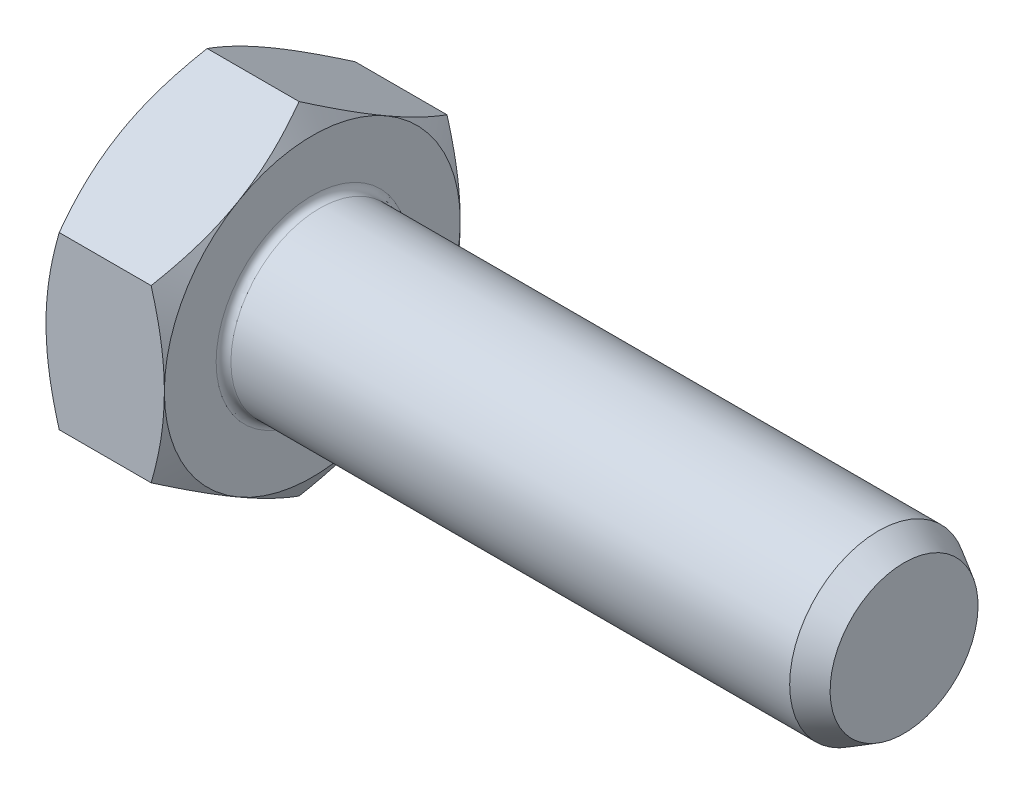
ISO-10303-21;
HEADER;
FILE_DESCRIPTION(('STEP AP214'),'2;1');
FILE_NAME('part.step','',(''),(''),'','','');
FILE_SCHEMA(('AUTOMOTIVE_DESIGN { 1 0 10303 214 1 1 1 1 }'));
ENDSEC;
DATA;
#1=APPLICATION_CONTEXT('core data for automotive mechanical design processes');
#2=APPLICATION_PROTOCOL_DEFINITION('international standard','automotive_design',2000,#1);
#3=PRODUCT_CONTEXT('',#1,'mechanical');
#4=PRODUCT('Part','Part','',(#3));
#5=PRODUCT_RELATED_PRODUCT_CATEGORY('part','',(#4));
#6=PRODUCT_DEFINITION_FORMATION('','',#4);
#7=PRODUCT_DEFINITION_CONTEXT('part definition',#1,'design');
#8=PRODUCT_DEFINITION('design','',#6,#7);
#9=PRODUCT_DEFINITION_SHAPE('','',#8);
#10=(LENGTH_UNIT() NAMED_UNIT(*) SI_UNIT(.MILLI.,.METRE.));
#11=(NAMED_UNIT(*) PLANE_ANGLE_UNIT() SI_UNIT($,.RADIAN.));
#12=(NAMED_UNIT(*) SI_UNIT($,.STERADIAN.) SOLID_ANGLE_UNIT());
#13=UNCERTAINTY_MEASURE_WITH_UNIT(LENGTH_MEASURE(1.E-05),#10,'distance_accuracy_value','');
#14=(GEOMETRIC_REPRESENTATION_CONTEXT(3) GLOBAL_UNCERTAINTY_ASSIGNED_CONTEXT((#13)) GLOBAL_UNIT_ASSIGNED_CONTEXT((#10,
#11,#12)) REPRESENTATION_CONTEXT('',''));
#15=CARTESIAN_POINT('',(0.,0.,0.));
#16=DIRECTION('',(0.,0.,1.));
#17=DIRECTION('',(1.,0.,0.));
#18=AXIS2_PLACEMENT_3D('',#15,#16,#17);
#19=CARTESIAN_POINT('',(0.,0.,-10.));
#20=DIRECTION('',(-1.,0.,0.));
#21=DIRECTION('',(0.,0.,1.));
#22=AXIS2_PLACEMENT_3D('',#19,#20,#21);
#23=PLANE('',#22);
#24=CARTESIAN_POINT('',(0.,0.,0.));
#25=DIRECTION('',(-1.,0.,0.));
#26=DIRECTION('',(0.,0.,1.));
#27=AXIS2_PLACEMENT_3D('',#24,#25,#26);
#28=CIRCLE('',#27,5.);
#29=CARTESIAN_POINT('',(0.,-4.3301270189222,2.5));
#30=VERTEX_POINT('',#29);
#31=CARTESIAN_POINT('',(0.,0.,5.));
#32=VERTEX_POINT('',#31);
#33=EDGE_CURVE('E170',#30,#32,#28,.T.);
#34=ORIENTED_EDGE('',*,*,#33,.T.);
#35=CARTESIAN_POINT('',(0.,0.,0.));
#36=DIRECTION('',(-1.,0.,0.));
#37=DIRECTION('',(0.,0.,1.));
#38=AXIS2_PLACEMENT_3D('',#35,#36,#37);
#39=CIRCLE('',#38,5.);
#40=CARTESIAN_POINT('',(0.,4.33012701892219,2.5));
#41=VERTEX_POINT('',#40);
#42=EDGE_CURVE('E226',#32,#41,#39,.T.);
#43=ORIENTED_EDGE('',*,*,#42,.T.);
#44=CARTESIAN_POINT('',(0.,4.33012701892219,-2.5));
#45=VERTEX_POINT('',#44);
#46=EDGE_CURVE('E173',#41,#45,#28,.T.);
#47=ORIENTED_EDGE('',*,*,#46,.T.);
#48=CARTESIAN_POINT('',(0.,0.,-5.));
#49=VERTEX_POINT('',#48);
#50=EDGE_CURVE('E180',#45,#49,#28,.T.);
#51=ORIENTED_EDGE('',*,*,#50,.T.);
#52=CARTESIAN_POINT('',(0.,-4.33012701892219,-2.5));
#53=VERTEX_POINT('',#52);
#54=EDGE_CURVE('E178',#49,#53,#28,.T.);
#55=ORIENTED_EDGE('',*,*,#54,.T.);
#56=EDGE_CURVE('E172',#53,#30,#28,.T.);
#57=ORIENTED_EDGE('',*,*,#56,.T.);
#58=EDGE_LOOP('',(#34,#43,#47,#51,#55,#57));
#59=FACE_BOUND('',#58,.T.);
#60=CARTESIAN_POINT('',(0.,0.,0.));
#61=DIRECTION('',(-1.,0.,0.));
#62=DIRECTION('',(0.,0.,1.));
#63=AXIS2_PLACEMENT_3D('',#60,#61,#62);
#64=CIRCLE('',#63,4.16666666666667);
#65=CARTESIAN_POINT('',(0.,0.,4.16666666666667));
#66=VERTEX_POINT('',#65);
#67=EDGE_CURVE('E367',#66,#66,#64,.T.);
#68=ORIENTED_EDGE('',*,*,#67,.F.);
#69=EDGE_LOOP('',(#68));
#70=FACE_BOUND('',#69,.T.);
#71=ADVANCED_FACE('F43',(#59,#70),#23,.T.);
#72=CARTESIAN_POINT('',(-14.1054061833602,0.,0.));
#73=DIRECTION('',(-1.,0.,0.));
#74=DIRECTION('',(0.,0.,1.));
#75=AXIS2_PLACEMENT_3D('',#72,#73,#74);
#76=CYLINDRICAL_SURFACE('',#75,3.);
#77=CARTESIAN_POINT('',(4.25,0.,0.));
#78=DIRECTION('',(-1.,0.,0.));
#79=DIRECTION('',(0.,0.,1.));
#80=AXIS2_PLACEMENT_3D('',#77,#78,#79);
#81=CIRCLE('',#80,3.);
#82=CARTESIAN_POINT('',(4.25,0.,3.));
#83=VERTEX_POINT('',#82);
#84=EDGE_CURVE('E159',#83,#83,#81,.F.);
#85=ORIENTED_EDGE('',*,*,#84,.T.);
#86=EDGE_LOOP('',(#85));
#87=FACE_BOUND('',#86,.T.);
#88=CARTESIAN_POINT('',(23.1339745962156,0.,0.));
#89=DIRECTION('',(1.,0.,0.));
#90=DIRECTION('',(0.,1.,0.));
#91=AXIS2_PLACEMENT_3D('',#88,#89,#90);
#92=CIRCLE('',#91,3.);
#93=CARTESIAN_POINT('',(23.1339745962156,3.,0.));
#94=VERTEX_POINT('',#93);
#95=EDGE_CURVE('E365',#94,#94,#92,.T.);
#96=ORIENTED_EDGE('',*,*,#95,.F.);
#97=EDGE_LOOP('',(#96));
#98=FACE_BOUND('',#97,.T.);
#99=ADVANCED_FACE('F338',(#87,#98),#76,.T.);
#100=CARTESIAN_POINT('',(4.,0.,-10.));
#101=DIRECTION('',(-1.,0.,0.));
#102=DIRECTION('',(0.,0.,1.));
#103=AXIS2_PLACEMENT_3D('',#100,#101,#102);
#104=PLANE('',#103);
#105=CARTESIAN_POINT('',(4.,0.,0.));
#106=DIRECTION('',(-1.,0.,0.));
#107=DIRECTION('',(0.,0.,1.));
#108=AXIS2_PLACEMENT_3D('',#105,#106,#107);
#109=CIRCLE('',#108,3.25);
#110=CARTESIAN_POINT('',(4.,0.,3.25));
#111=VERTEX_POINT('',#110);
#112=EDGE_CURVE('E167',#111,#111,#109,.T.);
#113=ORIENTED_EDGE('',*,*,#112,.T.);
#114=EDGE_LOOP('',(#113));
#115=FACE_BOUND('',#114,.T.);
#116=CARTESIAN_POINT('',(4.,0.,0.));
#117=DIRECTION('',(-1.,0.,0.));
#118=DIRECTION('',(0.,0.,1.));
#119=AXIS2_PLACEMENT_3D('',#116,#117,#118);
#120=CIRCLE('',#119,5.);
#121=CARTESIAN_POINT('',(4.,0.,5.));
#122=VERTEX_POINT('',#121);
#123=CARTESIAN_POINT('',(4.,4.33012701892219,2.5));
#124=VERTEX_POINT('',#123);
#125=EDGE_CURVE('E138',#122,#124,#120,.T.);
#126=ORIENTED_EDGE('',*,*,#125,.F.);
#127=CARTESIAN_POINT('',(4.,0.,0.));
#128=DIRECTION('',(-1.,0.,0.));
#129=DIRECTION('',(0.,0.,1.));
#130=AXIS2_PLACEMENT_3D('',#127,#128,#129);
#131=CIRCLE('',#130,5.);
#132=CARTESIAN_POINT('',(4.,-4.3301270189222,2.5));
#133=VERTEX_POINT('',#132);
#134=EDGE_CURVE('E47',#133,#122,#131,.T.);
#135=ORIENTED_EDGE('',*,*,#134,.F.);
#136=CARTESIAN_POINT('',(4.,-4.33012701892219,-2.5));
#137=VERTEX_POINT('',#136);
#138=EDGE_CURVE('E183',#137,#133,#131,.T.);
#139=ORIENTED_EDGE('',*,*,#138,.F.);
#140=CARTESIAN_POINT('',(4.,0.,-5.));
#141=VERTEX_POINT('',#140);
#142=EDGE_CURVE('E575',#141,#137,#131,.T.);
#143=ORIENTED_EDGE('',*,*,#142,.F.);
#144=CARTESIAN_POINT('',(4.,4.33012701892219,-2.5));
#145=VERTEX_POINT('',#144);
#146=EDGE_CURVE('E52',#145,#141,#131,.T.);
#147=ORIENTED_EDGE('',*,*,#146,.F.);
#148=EDGE_CURVE('E11',#124,#145,#131,.T.);
#149=ORIENTED_EDGE('',*,*,#148,.F.);
#150=EDGE_LOOP('',(#126,#135,#139,#143,#147,#149));
#151=FACE_BOUND('',#150,.T.);
#152=ADVANCED_FACE('F344',(#115,#151),#104,.F.);
#153=CARTESIAN_POINT('',(4.25,0.,0.));
#154=DIRECTION('',(-1.,0.,0.));
#155=DIRECTION('',(0.,0.,1.));
#156=AXIS2_PLACEMENT_3D('',#153,#154,#155);
#157=TOROIDAL_SURFACE('',#156,3.25,0.25);
#158=ORIENTED_EDGE('',*,*,#112,.F.);
#159=EDGE_LOOP('',(#158));
#160=FACE_BOUND('',#159,.T.);
#161=ORIENTED_EDGE('',*,*,#84,.F.);
#162=EDGE_LOOP('',(#161));
#163=FACE_BOUND('',#162,.T.);
#164=ADVANCED_FACE('F45',(#160,#163),#157,.F.);
#165=CARTESIAN_POINT('',(3.5534180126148,0.,0.));
#166=DIRECTION('',(-1.,0.,0.));
#167=DIRECTION('',(0.,0.,1.));
#168=AXIS2_PLACEMENT_3D('',#165,#166,#167);
#169=CONICAL_SURFACE('',#168,5.77350269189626,1.04719755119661);
#170=CARTESIAN_POINT('',(1.60736647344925,-7.65608998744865,5.));
#171=CARTESIAN_POINT('',(1.71345466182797,-7.43656171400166,5.));
#172=CARTESIAN_POINT('',(1.81848824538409,-7.21651440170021,5.));
#173=CARTESIAN_POINT('',(2.02584356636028,-6.77510105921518,5.));
#174=CARTESIAN_POINT('',(2.12816483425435,-6.55373480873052,5.));
#175=CARTESIAN_POINT('',(2.33003192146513,-6.10820714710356,5.));
#176=CARTESIAN_POINT('',(2.42955850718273,-5.88403698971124,5.));
#177=CARTESIAN_POINT('',(2.62433676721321,-5.43385418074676,5.));
#178=CARTESIAN_POINT('',(2.7195886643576,-5.20784162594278,5.));
#179=CARTESIAN_POINT('',(2.90581169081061,-4.75080884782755,5.));
#180=CARTESIAN_POINT('',(2.99671590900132,-4.51976121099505,5.));
#181=CARTESIAN_POINT('',(3.17140469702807,-4.05494053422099,5.));
#182=CARTESIAN_POINT('',(3.25518847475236,-3.82116719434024,5.));
#183=CARTESIAN_POINT('',(3.41338536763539,-3.35100416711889,5.));
#184=CARTESIAN_POINT('',(3.48781840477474,-3.11462125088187,5.));
#185=CARTESIAN_POINT('',(3.62489560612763,-2.63849247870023,5.));
#186=CARTESIAN_POINT('',(3.68754349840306,-2.3987477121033,5.));
#187=CARTESIAN_POINT('',(3.79801224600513,-1.91574303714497,5.));
#188=CARTESIAN_POINT('',(3.84582915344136,-1.672482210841,5.));
#189=CARTESIAN_POINT('',(3.9234044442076,-1.18299359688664,5.));
#190=CARTESIAN_POINT('',(3.95316281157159,-0.936765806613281,5.));
#191=CARTESIAN_POINT('',(3.9823487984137,-0.567032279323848,5.));
#192=CARTESIAN_POINT('',(3.98950368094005,-0.444105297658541,5.));
#193=CARTESIAN_POINT('',(3.99860454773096,-0.198053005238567,5.));
#194=CARTESIAN_POINT('',(4.00055059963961,-0.0749276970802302,5.));
#195=CARTESIAN_POINT('',(3.99918152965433,0.171257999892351,5.));
#196=CARTESIAN_POINT('',(3.99586788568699,0.294318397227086,5.));
#197=CARTESIAN_POINT('',(3.98406340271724,0.540192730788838,5.));
#198=CARTESIAN_POINT('',(3.97557230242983,0.66300665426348,5.));
#199=CARTESIAN_POINT('',(3.9488936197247,0.960681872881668,5.));
#200=CARTESIAN_POINT('',(3.92811103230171,1.1353143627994,5.));
#201=CARTESIAN_POINT('',(3.8772343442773,1.4832167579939,5.));
#202=CARTESIAN_POINT('',(3.84713900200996,1.65648647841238,5.));
#203=CARTESIAN_POINT('',(3.77870120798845,2.00155426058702,5.));
#204=CARTESIAN_POINT('',(3.74035052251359,2.17335067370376,5.));
#205=CARTESIAN_POINT('',(3.65657169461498,2.51518168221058,5.));
#206=CARTESIAN_POINT('',(3.61114398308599,2.68521638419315,5.));
#207=CARTESIAN_POINT('',(3.5131122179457,3.02770318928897,5.));
#208=CARTESIAN_POINT('',(3.46035963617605,3.20011248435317,5.));
#209=CARTESIAN_POINT('',(3.34964221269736,3.54310870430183,5.));
#210=CARTESIAN_POINT('',(3.29168096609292,3.71369679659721,5.));
#211=CARTESIAN_POINT('',(3.17174345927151,4.05236610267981,5.));
#212=CARTESIAN_POINT('',(3.10979163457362,4.22045602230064,5.));
#213=CARTESIAN_POINT('',(2.98225176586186,4.55533171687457,5.));
#214=CARTESIAN_POINT('',(2.91666225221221,4.72211693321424,5.));
#215=CARTESIAN_POINT('',(2.84961374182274,4.88829623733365,5.));
#216=B_SPLINE_CURVE_WITH_KNOTS('',3,(#170,#171,#172,#173,#174,#175,#176,#177,#178,#179,#180,
#181,#182,#183,#184,#185,#186,#187,#188,#189,#190,#191,#192,#193,#194,#195,#196,#197,#198,#199,
#200,#201,#202,#203,#204,#205,#206,#207,#208,#209,#210,#211,#212,#213,#214,#215),.UNSPECIFIED.,
.F.,.F.,(4,2,2,2,2,2,2,2,2,2,2,2,2,2,2,2,2,2,2,2,2,2,4),(0.,0.731464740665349,1.46305528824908,
2.19883243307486,2.93457117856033,3.67934251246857,4.4241965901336,5.16743580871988,
5.91043951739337,6.65364083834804,7.39684281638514,7.76615414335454,8.13546067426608,
8.50466345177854,8.8738848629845,9.40118542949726,9.92855633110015,10.4564556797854,
10.9843228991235,11.5251202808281,12.0655472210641,12.6029322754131,13.1405360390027),.UNSPECIFIED.);
#217=CARTESIAN_POINT('',(3.5534180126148,-2.88675134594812,5.00000000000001));
#218=VERTEX_POINT('',#217);
#219=EDGE_CURVE('E150',#122,#218,#216,.F.);
#220=ORIENTED_EDGE('',*,*,#219,.T.);
#221=CARTESIAN_POINT('',(3.55335134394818,-2.88663587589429,5.0002));
#222=CARTESIAN_POINT('',(3.62661343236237,-3.01349970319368,4.78046540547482));
#223=CARTESIAN_POINT('',(3.69324867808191,-3.14144859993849,4.55885141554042));
#224=CARTESIAN_POINT('',(3.80956100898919,-3.39956193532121,4.11178600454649));
#225=CARTESIAN_POINT('',(3.85919695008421,-3.52973095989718,3.88632664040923));
#226=CARTESIAN_POINT('',(3.9364489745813,-3.78847564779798,3.43816769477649));
#227=CARTESIAN_POINT('',(3.96457962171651,-3.91701101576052,3.21553790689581));
#228=CARTESIAN_POINT('',(3.98980507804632,-4.11026620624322,2.88081009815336));
#229=CARTESIAN_POINT('',(3.99538654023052,-4.17472868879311,2.76915780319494));
#230=CARTESIAN_POINT('',(4.00079778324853,-4.30371322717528,2.54575002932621));
#231=CARTESIAN_POINT('',(4.0006277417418,-4.36823528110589,2.43399455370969));
#232=CARTESIAN_POINT('',(3.99224636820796,-4.54500768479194,2.12781576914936));
#233=CARTESIAN_POINT('',(3.97817022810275,-4.65719946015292,1.93349391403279));
#234=CARTESIAN_POINT('',(3.93353474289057,-4.88083840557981,1.5461398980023));
#235=CARTESIAN_POINT('',(3.90296013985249,-4.9922847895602,1.35310909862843));
#236=CARTESIAN_POINT('',(3.82653150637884,-5.21637431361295,0.964974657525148));
#237=CARTESIAN_POINT('',(3.78035362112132,-5.32898917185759,0.769920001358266));
#238=CARTESIAN_POINT('',(3.67554820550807,-5.55253939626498,0.382719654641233));
#239=CARTESIAN_POINT('',(3.61694529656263,-5.66347762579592,0.190569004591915));
#240=CARTESIAN_POINT('',(3.55335134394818,-5.7736181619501,-0.00019999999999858));
#241=B_SPLINE_CURVE_WITH_KNOTS('',3,(#221,#222,#223,#224,#225,#226,#227,#228,#229,#230,#231,
#232,#233,#234,#235,#236,#237,#238,#239,#240),.UNSPECIFIED.,.F.,.F.,(4,2,2,2,2,2,2,2,2,4),(0.,
0.792555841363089,1.58701660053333,2.3618153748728,2.74884076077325,3.13585419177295,
3.80962362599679,4.48401723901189,5.17336882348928,5.86136694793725),.UNSPECIFIED.);
#242=EDGE_CURVE('E572',#218,#133,#241,.T.);
#243=ORIENTED_EDGE('',*,*,#242,.T.);
#244=ORIENTED_EDGE('',*,*,#134,.T.);
#245=EDGE_LOOP('',(#220,#243,#244));
#246=FACE_BOUND('',#245,.T.);
#247=ADVANCED_FACE('F455',(#246),#169,.T.);
#248=CARTESIAN_POINT('',(3.5534180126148,-5.77350269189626,0.));
#249=VERTEX_POINT('',#248);
#250=EDGE_CURVE('E277',#133,#249,#241,.T.);
#251=ORIENTED_EDGE('',*,*,#250,.T.);
#252=CARTESIAN_POINT('',(3.55335134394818,-5.7736181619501,0.000200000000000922));
#253=CARTESIAN_POINT('',(3.62661343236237,-5.64675433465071,-0.219534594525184));
#254=CARTESIAN_POINT('',(3.69324867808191,-5.5188054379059,-0.441148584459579));
#255=CARTESIAN_POINT('',(3.80956100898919,-5.26069210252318,-0.888213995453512));
#256=CARTESIAN_POINT('',(3.85919695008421,-5.13052307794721,-1.11367335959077));
#257=CARTESIAN_POINT('',(3.9364489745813,-4.87177839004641,-1.56183230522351));
#258=CARTESIAN_POINT('',(3.96457962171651,-4.74324302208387,-1.78446209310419));
#259=CARTESIAN_POINT('',(3.98980507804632,-4.54998783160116,-2.11918990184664));
#260=CARTESIAN_POINT('',(3.99538654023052,-4.48552534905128,-2.23084219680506));
#261=CARTESIAN_POINT('',(4.00079778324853,-4.35654081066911,-2.45424997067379));
#262=CARTESIAN_POINT('',(4.0006277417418,-4.2920187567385,-2.56600544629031));
#263=CARTESIAN_POINT('',(3.99224636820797,-4.11524635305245,-2.87218423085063));
#264=CARTESIAN_POINT('',(3.97817022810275,-4.00305457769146,-3.06650608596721));
#265=CARTESIAN_POINT('',(3.93353474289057,-3.77941563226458,-3.4538601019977));
#266=CARTESIAN_POINT('',(3.90296013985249,-3.66796924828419,-3.64689090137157));
#267=CARTESIAN_POINT('',(3.82653150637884,-3.44387972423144,-4.03502534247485));
#268=CARTESIAN_POINT('',(3.78035362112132,-3.3312648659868,-4.23007999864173));
#269=CARTESIAN_POINT('',(3.67554820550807,-3.1077146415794,-4.61728034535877));
#270=CARTESIAN_POINT('',(3.61694529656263,-2.99677641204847,-4.80943099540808));
#271=CARTESIAN_POINT('',(3.55335134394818,-2.88663587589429,-5.0002));
#272=B_SPLINE_CURVE_WITH_KNOTS('',3,(#252,#253,#254,#255,#256,#257,#258,#259,#260,#261,#262,
#263,#264,#265,#266,#267,#268,#269,#270,#271),.UNSPECIFIED.,.F.,.F.,(4,2,2,2,2,2,2,2,2,4),(0.,
0.79255584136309,1.58701660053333,2.3618153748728,2.74884076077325,3.13585419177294,
3.80962362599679,4.48401723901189,5.17336882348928,5.86136694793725),.UNSPECIFIED.);
#273=EDGE_CURVE('E573',#249,#137,#272,.T.);
#274=ORIENTED_EDGE('',*,*,#273,.T.);
#275=ORIENTED_EDGE('',*,*,#138,.T.);
#276=EDGE_LOOP('',(#251,#274,#275));
#277=FACE_BOUND('',#276,.T.);
#278=ADVANCED_FACE('F476',(#277),#169,.T.);
#279=CARTESIAN_POINT('',(3.5534180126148,-2.88675134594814,-5.));
#280=VERTEX_POINT('',#279);
#281=EDGE_CURVE('E258',#137,#280,#272,.T.);
#282=ORIENTED_EDGE('',*,*,#281,.T.);
#283=CARTESIAN_POINT('',(1.60736561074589,-7.65609177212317,-5.));
#284=CARTESIAN_POINT('',(1.71345383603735,-7.43656343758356,-5.));
#285=CARTESIAN_POINT('',(1.81848745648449,-7.21651606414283,-5.));
#286=CARTESIAN_POINT('',(2.02584285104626,-6.77510259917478,-5.));
#287=CARTESIAN_POINT('',(2.12816415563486,-6.55373628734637,-5.));
#288=CARTESIAN_POINT('',(2.33003131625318,-6.10820850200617,-5.));
#289=CARTESIAN_POINT('',(2.42955793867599,-5.88403828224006,-5.));
#290=CARTESIAN_POINT('',(2.62433627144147,-5.43385534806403,-5.));
#291=CARTESIAN_POINT('',(2.7195882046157,-5.20784273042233,-5.));
#292=CARTESIAN_POINT('',(2.90581130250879,-4.7508098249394,-5.));
#293=CARTESIAN_POINT('',(2.99671555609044,-4.5197621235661,-5.));
#294=CARTESIAN_POINT('',(3.17140441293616,-4.05494131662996,-5.));
#295=CARTESIAN_POINT('',(3.25518822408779,-3.82116791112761,-5.));
#296=CARTESIAN_POINT('',(3.4133851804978,-3.35100475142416,-5.));
#297=CARTESIAN_POINT('',(3.48781824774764,-3.11462176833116,-5.));
#298=CARTESIAN_POINT('',(3.62489550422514,-2.63849286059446,-5.));
#299=CARTESIAN_POINT('',(3.68754342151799,-2.39874802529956,-5.));
#300=CARTESIAN_POINT('',(3.79801221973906,-1.91574317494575,-5.));
#301=CARTESIAN_POINT('',(3.84582915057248,-1.67248224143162,-5.));
#302=CARTESIAN_POINT('',(3.92340447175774,-1.18299341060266,-5.));
#303=CARTESIAN_POINT('',(3.95316284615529,-0.936765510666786,-5.));
#304=CARTESIAN_POINT('',(3.98234882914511,-0.567031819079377,-5.));
#305=CARTESIAN_POINT('',(3.98950370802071,-0.444104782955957,-5.));
#306=CARTESIAN_POINT('',(3.99860456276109,-0.198052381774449,-5.));
#307=CARTESIAN_POINT('',(4.0005506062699,-0.0749270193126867,-5.));
#308=CARTESIAN_POINT('',(3.99918151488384,0.171258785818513,-5.));
#309=CARTESIAN_POINT('',(3.99586785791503,0.294319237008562,-5.));
#310=CARTESIAN_POINT('',(3.98406334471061,0.540193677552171,-5.));
#311=CARTESIAN_POINT('',(3.97557222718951,0.663007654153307,-5.));
#312=CARTESIAN_POINT('',(3.94889350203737,0.960682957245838,-5.));
#313=CARTESIAN_POINT('',(3.92811089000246,1.13531547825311,-5.));
#314=CARTESIAN_POINT('',(3.87723415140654,1.48321793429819,-5.));
#315=CARTESIAN_POINT('',(3.84713878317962,1.65648768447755,-5.));
#316=CARTESIAN_POINT('',(3.77870093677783,2.00155552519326,-5.));
#317=CARTESIAN_POINT('',(3.74035022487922,2.17335196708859,-5.));
#318=CARTESIAN_POINT('',(3.65657134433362,2.51518303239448,-5.));
#319=CARTESIAN_POINT('',(3.61114360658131,2.68521776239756,-5.));
#320=CARTESIAN_POINT('',(3.51311178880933,3.02770462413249,-5.));
#321=CARTESIAN_POINT('',(3.46035918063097,3.20011394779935,-5.));
#322=CARTESIAN_POINT('',(3.349641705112,3.5431102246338,-5.));
#323=CARTESIAN_POINT('',(3.29168043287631,3.71369834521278,-5.));
#324=CARTESIAN_POINT('',(3.17174287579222,4.05236770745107,-5.));
#325=CARTESIAN_POINT('',(3.10979102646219,4.22045765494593,-5.));
#326=CARTESIAN_POINT('',(2.98225110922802,4.55533340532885,-5.));
#327=CARTESIAN_POINT('',(2.91666157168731,4.72211864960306,-5.));
#328=CARTESIAN_POINT('',(2.84961303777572,4.88829798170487,-5.));
#329=B_SPLINE_CURVE_WITH_KNOTS('',3,(#283,#284,#285,#286,#287,#288,#289,#290,#291,#292,#293,
#294,#295,#296,#297,#298,#299,#300,#301,#302,#303,#304,#305,#306,#307,#308,#309,#310,#311,#312,
#313,#314,#315,#316,#317,#318,#319,#320,#321,#322,#323,#324,#325,#326,#327,#328),.UNSPECIFIED.,
.F.,.F.,(4,2,2,2,2,2,2,2,2,2,2,2,2,2,2,2,2,2,2,2,2,2,4),(0.,0.731464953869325,1.4630557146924,
2.19883307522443,2.93457203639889,3.67934358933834,4.42419788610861,5.16743732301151,
5.91044124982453,6.6536428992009,7.39684520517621,7.76615669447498,8.13546338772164,
8.50466632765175,8.87388790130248,9.40118856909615,9.92855957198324,10.4564590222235,
10.9843263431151,11.5251238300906,12.0655508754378,12.6029360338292,13.1405399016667),.UNSPECIFIED.);
#330=EDGE_CURVE('E256',#280,#141,#329,.T.);
#331=ORIENTED_EDGE('',*,*,#330,.T.);
#332=ORIENTED_EDGE('',*,*,#142,.T.);
#333=EDGE_LOOP('',(#282,#331,#332));
#334=FACE_BOUND('',#333,.T.);
#335=ADVANCED_FACE('F269',(#334),#169,.T.);
#336=CARTESIAN_POINT('',(3.55335134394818,2.8866358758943,-5.0002));
#337=CARTESIAN_POINT('',(3.62661343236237,3.01349970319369,-4.78046540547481));
#338=CARTESIAN_POINT('',(3.69324867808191,3.1414485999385,-4.55885141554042));
#339=CARTESIAN_POINT('',(3.80956100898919,3.39956193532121,-4.11178600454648));
#340=CARTESIAN_POINT('',(3.85919695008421,3.52973095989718,-3.88632664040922));
#341=CARTESIAN_POINT('',(3.9364489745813,3.78847564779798,-3.43816769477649));
#342=CARTESIAN_POINT('',(3.96457962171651,3.91701101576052,-3.21553790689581));
#343=CARTESIAN_POINT('',(3.98980507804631,4.11026620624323,-2.88081009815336));
#344=CARTESIAN_POINT('',(3.99538654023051,4.17472868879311,-2.76915780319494));
#345=CARTESIAN_POINT('',(4.00079778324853,4.30371322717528,-2.5457500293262));
#346=CARTESIAN_POINT('',(4.00062774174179,4.36823528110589,-2.43399455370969));
#347=CARTESIAN_POINT('',(3.99224636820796,4.54500768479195,-2.12781576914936));
#348=CARTESIAN_POINT('',(3.97817022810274,4.65719946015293,-1.93349391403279));
#349=CARTESIAN_POINT('',(3.93353474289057,4.88083840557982,-1.5461398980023));
#350=CARTESIAN_POINT('',(3.90296013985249,4.99228478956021,-1.35310909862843));
#351=CARTESIAN_POINT('',(3.82653150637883,5.21637431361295,-0.964974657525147));
#352=CARTESIAN_POINT('',(3.78035362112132,5.32898917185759,-0.769920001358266));
#353=CARTESIAN_POINT('',(3.67554820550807,5.55253939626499,-0.382719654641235));
#354=CARTESIAN_POINT('',(3.61694529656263,5.66347762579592,-0.190569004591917));
#355=CARTESIAN_POINT('',(3.55335134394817,5.7736181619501,0.000199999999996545));
#356=B_SPLINE_CURVE_WITH_KNOTS('',3,(#336,#337,#338,#339,#340,#341,#342,#343,#344,#345,#346,
#347,#348,#349,#350,#351,#352,#353,#354,#355),.UNSPECIFIED.,.F.,.F.,(4,2,2,2,2,2,2,2,2,4),(0.,
0.79255584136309,1.58701660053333,2.3618153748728,2.74884076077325,3.13585419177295,
3.80962362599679,4.48401723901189,5.17336882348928,5.86136694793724),.UNSPECIFIED.);
#357=CARTESIAN_POINT('',(3.5534180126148,2.88675134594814,-5.));
#358=VERTEX_POINT('',#357);
#359=EDGE_CURVE('E66',#358,#145,#356,.T.);
#360=ORIENTED_EDGE('',*,*,#359,.T.);
#361=ORIENTED_EDGE('',*,*,#146,.T.);
#362=EDGE_CURVE('E249',#141,#358,#329,.T.);
#363=ORIENTED_EDGE('',*,*,#362,.T.);
#364=EDGE_LOOP('',(#360,#361,#363));
#365=FACE_BOUND('',#364,.T.);
#366=ADVANCED_FACE('F264',(#365),#169,.T.);
#367=CARTESIAN_POINT('',(3.5534180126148,5.77350269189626,0.));
#368=VERTEX_POINT('',#367);
#369=EDGE_CURVE('E292',#145,#368,#356,.T.);
#370=ORIENTED_EDGE('',*,*,#369,.T.);
#371=CARTESIAN_POINT('',(3.55335134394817,5.7736181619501,-0.000200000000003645));
#372=CARTESIAN_POINT('',(3.62661343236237,5.64675433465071,0.219534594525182));
#373=CARTESIAN_POINT('',(3.69324867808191,5.5188054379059,0.441148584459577));
#374=CARTESIAN_POINT('',(3.80956100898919,5.26069210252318,0.88821399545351));
#375=CARTESIAN_POINT('',(3.85919695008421,5.13052307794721,1.11367335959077));
#376=CARTESIAN_POINT('',(3.9364489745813,4.87177839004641,1.56183230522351));
#377=CARTESIAN_POINT('',(3.96457962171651,4.74324302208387,1.78446209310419));
#378=CARTESIAN_POINT('',(3.98980507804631,4.54998783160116,2.11918990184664));
#379=CARTESIAN_POINT('',(3.99538654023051,4.48552534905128,2.23084219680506));
#380=CARTESIAN_POINT('',(4.00079778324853,4.35654081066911,2.45424997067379));
#381=CARTESIAN_POINT('',(4.00062774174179,4.2920187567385,2.56600544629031));
#382=CARTESIAN_POINT('',(3.99224636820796,4.11524635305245,2.87218423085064));
#383=CARTESIAN_POINT('',(3.97817022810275,4.00305457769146,3.06650608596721));
#384=CARTESIAN_POINT('',(3.93353474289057,3.77941563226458,3.4538601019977));
#385=CARTESIAN_POINT('',(3.90296013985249,3.66796924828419,3.64689090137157));
#386=CARTESIAN_POINT('',(3.82653150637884,3.44387972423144,4.03502534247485));
#387=CARTESIAN_POINT('',(3.78035362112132,3.3312648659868,4.23007999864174));
#388=CARTESIAN_POINT('',(3.67554820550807,3.1077146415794,4.61728034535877));
#389=CARTESIAN_POINT('',(3.61694529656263,2.99677641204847,4.80943099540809));
#390=CARTESIAN_POINT('',(3.55335134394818,2.88663587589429,5.0002));
#391=B_SPLINE_CURVE_WITH_KNOTS('',3,(#371,#372,#373,#374,#375,#376,#377,#378,#379,#380,#381,
#382,#383,#384,#385,#386,#387,#388,#389,#390),.UNSPECIFIED.,.F.,.F.,(4,2,2,2,2,2,2,2,2,4),(0.,
0.792555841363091,1.58701660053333,2.3618153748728,2.74884076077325,3.13585419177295,
3.80962362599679,4.48401723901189,5.17336882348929,5.86136694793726),.UNSPECIFIED.);
#392=EDGE_CURVE('E58',#368,#124,#391,.T.);
#393=ORIENTED_EDGE('',*,*,#392,.T.);
#394=ORIENTED_EDGE('',*,*,#148,.T.);
#395=EDGE_LOOP('',(#370,#393,#394));
#396=FACE_BOUND('',#395,.T.);
#397=ADVANCED_FACE('F268',(#396),#169,.T.);
#398=CARTESIAN_POINT('',(3.5534180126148,2.88675134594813,5.));
#399=VERTEX_POINT('',#398);
#400=EDGE_CURVE('E132',#124,#399,#391,.T.);
#401=ORIENTED_EDGE('',*,*,#400,.T.);
#402=EDGE_CURVE('E135',#399,#122,#216,.F.);
#403=ORIENTED_EDGE('',*,*,#402,.T.);
#404=ORIENTED_EDGE('',*,*,#125,.T.);
#405=EDGE_LOOP('',(#401,#403,#404));
#406=FACE_BOUND('',#405,.T.);
#407=ADVANCED_FACE('F134',(#406),#169,.T.);
#408=CARTESIAN_POINT('',(0.,0.,0.));
#409=DIRECTION('',(1.,0.,0.));
#410=DIRECTION('',(0.,0.,-1.));
#411=AXIS2_PLACEMENT_3D('',#408,#409,#410);
#412=CONICAL_SURFACE('',#411,5.,1.0471975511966);
#413=CARTESIAN_POINT('',(0.446648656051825,2.88663587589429,5.0002));
#414=CARTESIAN_POINT('',(0.373386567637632,3.01349970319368,4.78046540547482));
#415=CARTESIAN_POINT('',(0.30675132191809,3.14144859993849,4.55885141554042));
#416=CARTESIAN_POINT('',(0.19043899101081,3.39956193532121,4.11178600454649));
#417=CARTESIAN_POINT('',(0.140803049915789,3.52973095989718,3.88632664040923));
#418=CARTESIAN_POINT('',(0.0635510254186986,3.78847564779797,3.43816769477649));
#419=CARTESIAN_POINT('',(0.0354203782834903,3.91701101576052,3.21553790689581));
#420=CARTESIAN_POINT('',(0.0101949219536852,4.11026620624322,2.88081009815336));
#421=CARTESIAN_POINT('',(0.00461345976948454,4.17472868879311,2.76915780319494));
#422=CARTESIAN_POINT('',(-0.000797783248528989,4.30371322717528,2.54575002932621));
#423=CARTESIAN_POINT('',(-0.000627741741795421,4.36823528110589,2.43399455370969));
#424=CARTESIAN_POINT('',(0.00775363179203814,4.54500768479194,2.12781576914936));
#425=CARTESIAN_POINT('',(0.0218297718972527,4.65719946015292,1.93349391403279));
#426=CARTESIAN_POINT('',(0.0664652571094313,4.88083840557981,1.5461398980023));
#427=CARTESIAN_POINT('',(0.0970398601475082,4.9922847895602,1.35310909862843));
#428=CARTESIAN_POINT('',(0.173468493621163,5.21637431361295,0.964974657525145));
#429=CARTESIAN_POINT('',(0.219646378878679,5.32898917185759,0.769920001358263));
#430=CARTESIAN_POINT('',(0.324451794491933,5.55253939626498,0.382719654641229));
#431=CARTESIAN_POINT('',(0.383054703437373,5.66347762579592,0.190569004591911));
#432=CARTESIAN_POINT('',(0.446648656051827,5.7736181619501,-0.000200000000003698));
#433=B_SPLINE_CURVE_WITH_KNOTS('',3,(#413,#414,#415,#416,#417,#418,#419,#420,#421,#422,#423,
#424,#425,#426,#427,#428,#429,#430,#431,#432),.UNSPECIFIED.,.F.,.F.,(4,2,2,2,2,2,2,2,2,4),(0.,
0.79255584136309,1.58701660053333,2.3618153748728,2.74884076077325,3.13585419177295,
3.80962362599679,4.48401723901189,5.17336882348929,5.86136694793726),.UNSPECIFIED.);
#434=CARTESIAN_POINT('',(0.4465819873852,5.77350269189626,0.));
#435=VERTEX_POINT('',#434);
#436=EDGE_CURVE('E208',#41,#435,#433,.T.);
#437=ORIENTED_EDGE('',*,*,#436,.T.);
#438=CARTESIAN_POINT('',(0.446648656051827,5.7736181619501,0.000199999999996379));
#439=CARTESIAN_POINT('',(0.373386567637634,5.64675433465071,-0.219534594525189));
#440=CARTESIAN_POINT('',(0.306751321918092,5.5188054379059,-0.441148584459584));
#441=CARTESIAN_POINT('',(0.190438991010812,5.26069210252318,-0.888213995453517));
#442=CARTESIAN_POINT('',(0.14080304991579,5.13052307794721,-1.11367335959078));
#443=CARTESIAN_POINT('',(0.0635510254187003,4.87177839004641,-1.56183230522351));
#444=CARTESIAN_POINT('',(0.0354203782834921,4.74324302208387,-1.7844620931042));
#445=CARTESIAN_POINT('',(0.0101949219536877,4.54998783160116,-2.11918990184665));
#446=CARTESIAN_POINT('',(0.00461345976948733,4.48552534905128,-2.23084219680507));
#447=CARTESIAN_POINT('',(-0.000797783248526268,4.35654081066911,-2.4542499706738));
#448=CARTESIAN_POINT('',(-0.00062774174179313,4.2920187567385,-2.56600544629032));
#449=CARTESIAN_POINT('',(0.00775363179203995,4.11524635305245,-2.87218423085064));
#450=CARTESIAN_POINT('',(0.0218297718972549,4.00305457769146,-3.06650608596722));
#451=CARTESIAN_POINT('',(0.0664652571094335,3.77941563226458,-3.45386010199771));
#452=CARTESIAN_POINT('',(0.0970398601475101,3.66796924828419,-3.64689090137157));
#453=CARTESIAN_POINT('',(0.173468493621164,3.44387972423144,-4.03502534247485));
#454=CARTESIAN_POINT('',(0.21964637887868,3.3312648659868,-4.23007999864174));
#455=CARTESIAN_POINT('',(0.324451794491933,3.10771464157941,-4.61728034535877));
#456=CARTESIAN_POINT('',(0.383054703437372,2.99677641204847,-4.80943099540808));
#457=CARTESIAN_POINT('',(0.446648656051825,2.8866358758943,-5.0002));
#458=B_SPLINE_CURVE_WITH_KNOTS('',3,(#438,#439,#440,#441,#442,#443,#444,#445,#446,#447,#448,
#449,#450,#451,#452,#453,#454,#455,#456,#457),.UNSPECIFIED.,.F.,.F.,(4,2,2,2,2,2,2,2,2,4),(0.,
0.79255584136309,1.58701660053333,2.3618153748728,2.74884076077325,3.13585419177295,
3.80962362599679,4.48401723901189,5.17336882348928,5.86136694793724),.UNSPECIFIED.);
#459=EDGE_CURVE('E206',#435,#45,#458,.T.);
#460=ORIENTED_EDGE('',*,*,#459,.T.);
#461=ORIENTED_EDGE('',*,*,#46,.F.);
#462=EDGE_LOOP('',(#437,#460,#461));
#463=FACE_BOUND('',#462,.T.);
#464=ADVANCED_FACE('F425',(#463),#412,.T.);
#465=CARTESIAN_POINT('',(2.39263352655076,-7.65608998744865,5.));
#466=CARTESIAN_POINT('',(2.28654533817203,-7.43656171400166,5.));
#467=CARTESIAN_POINT('',(2.18151175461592,-7.21651440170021,5.));
#468=CARTESIAN_POINT('',(1.97415643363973,-6.77510105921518,5.));
#469=CARTESIAN_POINT('',(1.87183516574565,-6.55373480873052,5.));
#470=CARTESIAN_POINT('',(1.66996807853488,-6.10820714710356,5.));
#471=CARTESIAN_POINT('',(1.57044149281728,-5.88403698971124,5.));
#472=CARTESIAN_POINT('',(1.37566323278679,-5.43385418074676,5.));
#473=CARTESIAN_POINT('',(1.28041133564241,-5.20784162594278,5.));
#474=CARTESIAN_POINT('',(1.09418830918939,-4.75080884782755,5.));
#475=CARTESIAN_POINT('',(1.00328409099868,-4.51976121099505,5.));
#476=CARTESIAN_POINT('',(0.828595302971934,-4.05494053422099,5.));
#477=CARTESIAN_POINT('',(0.744811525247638,-3.82116719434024,5.));
#478=CARTESIAN_POINT('',(0.586614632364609,-3.35100416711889,5.));
#479=CARTESIAN_POINT('',(0.512181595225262,-3.11462125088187,5.));
#480=CARTESIAN_POINT('',(0.375104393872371,-2.63849247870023,5.));
#481=CARTESIAN_POINT('',(0.312456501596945,-2.3987477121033,5.));
#482=CARTESIAN_POINT('',(0.201987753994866,-1.91574303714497,5.));
#483=CARTESIAN_POINT('',(0.15417084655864,-1.672482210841,5.));
#484=CARTESIAN_POINT('',(0.0765955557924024,-1.18299359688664,5.));
#485=CARTESIAN_POINT('',(0.0468371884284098,-0.936765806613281,5.));
#486=CARTESIAN_POINT('',(0.0176512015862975,-0.567032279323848,5.));
#487=CARTESIAN_POINT('',(0.0104963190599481,-0.444105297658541,5.));
#488=CARTESIAN_POINT('',(0.00139545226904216,-0.198053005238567,5.));
#489=CARTESIAN_POINT('',(-0.000550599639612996,-0.0749276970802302,5.));
#490=CARTESIAN_POINT('',(0.000818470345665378,0.171257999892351,5.));
#491=CARTESIAN_POINT('',(0.00413211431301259,0.294318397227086,5.));
#492=CARTESIAN_POINT('',(0.0159365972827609,0.540192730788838,5.));
#493=CARTESIAN_POINT('',(0.0244276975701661,0.663006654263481,5.));
#494=CARTESIAN_POINT('',(0.051106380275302,0.960681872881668,5.));
#495=CARTESIAN_POINT('',(0.0718889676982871,1.1353143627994,5.));
#496=CARTESIAN_POINT('',(0.122765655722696,1.4832167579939,5.));
#497=CARTESIAN_POINT('',(0.152860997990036,1.65648647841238,5.));
#498=CARTESIAN_POINT('',(0.221298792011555,2.00155426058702,5.));
#499=CARTESIAN_POINT('',(0.259649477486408,2.17335067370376,5.));
#500=CARTESIAN_POINT('',(0.343428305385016,2.51518168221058,5.));
#501=CARTESIAN_POINT('',(0.388856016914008,2.68521638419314,5.));
#502=CARTESIAN_POINT('',(0.4868877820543,3.02770318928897,5.));
#503=CARTESIAN_POINT('',(0.53964036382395,3.20011248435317,5.));
#504=CARTESIAN_POINT('',(0.650357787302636,3.54310870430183,5.));
#505=CARTESIAN_POINT('',(0.708319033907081,3.71369679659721,5.));
#506=CARTESIAN_POINT('',(0.828256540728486,4.05236610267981,5.));
#507=CARTESIAN_POINT('',(0.890208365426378,4.22045602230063,5.));
#508=CARTESIAN_POINT('',(1.01774823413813,4.55533171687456,5.));
#509=CARTESIAN_POINT('',(1.08333774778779,4.72211693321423,5.));
#510=CARTESIAN_POINT('',(1.15038625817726,4.88829623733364,5.));
#511=B_SPLINE_CURVE_WITH_KNOTS('',3,(#465,#466,#467,#468,#469,#470,#471,#472,#473,#474,#475,
#476,#477,#478,#479,#480,#481,#482,#483,#484,#485,#486,#487,#488,#489,#490,#491,#492,#493,#494,
#495,#496,#497,#498,#499,#500,#501,#502,#503,#504,#505,#506,#507,#508,#509,#510),.UNSPECIFIED.,
.F.,.F.,(4,2,2,2,2,2,2,2,2,2,2,2,2,2,2,2,2,2,2,2,2,2,4),(0.,0.73146474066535,1.46305528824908,
2.19883243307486,2.93457117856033,3.67934251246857,4.4241965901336,5.16743580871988,
5.91043951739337,6.65364083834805,7.39684281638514,7.76615414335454,8.13546067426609,
8.50466345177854,8.87388486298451,9.40118542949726,9.92855633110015,10.4564556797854,
10.9843228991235,11.5251202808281,12.0655472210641,12.6029322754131,13.1405360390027),.UNSPECIFIED.);
#512=CARTESIAN_POINT('',(0.4465819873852,2.88675134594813,5.));
#513=VERTEX_POINT('',#512);
#514=EDGE_CURVE('E314',#32,#513,#511,.T.);
#515=ORIENTED_EDGE('',*,*,#514,.T.);
#516=EDGE_CURVE('E155',#513,#41,#433,.T.);
#517=ORIENTED_EDGE('',*,*,#516,.T.);
#518=ORIENTED_EDGE('',*,*,#42,.F.);
#519=EDGE_LOOP('',(#515,#517,#518));
#520=FACE_BOUND('',#519,.T.);
#521=ADVANCED_FACE('F335',(#520),#412,.T.);
#522=CARTESIAN_POINT('',(0.4465819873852,-2.88675134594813,5.00000000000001));
#523=VERTEX_POINT('',#522);
#524=EDGE_CURVE('E320',#523,#32,#511,.T.);
#525=ORIENTED_EDGE('',*,*,#524,.T.);
#526=ORIENTED_EDGE('',*,*,#33,.F.);
#527=CARTESIAN_POINT('',(0.446648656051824,-5.7736181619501,-0.000199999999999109));
#528=CARTESIAN_POINT('',(0.373386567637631,-5.64675433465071,0.219534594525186));
#529=CARTESIAN_POINT('',(0.306751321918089,-5.5188054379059,0.441148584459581));
#530=CARTESIAN_POINT('',(0.190438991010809,-5.26069210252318,0.888213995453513));
#531=CARTESIAN_POINT('',(0.140803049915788,-5.13052307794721,1.11367335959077));
#532=CARTESIAN_POINT('',(0.0635510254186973,-4.87177839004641,1.56183230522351));
#533=CARTESIAN_POINT('',(0.0354203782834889,-4.74324302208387,1.78446209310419));
#534=CARTESIAN_POINT('',(0.0101949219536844,-4.54998783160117,2.11918990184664));
#535=CARTESIAN_POINT('',(0.0046134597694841,-4.48552534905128,2.23084219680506));
#536=CARTESIAN_POINT('',(-0.000797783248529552,-4.35654081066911,2.4542499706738));
#537=CARTESIAN_POINT('',(-0.000627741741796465,-4.2920187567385,2.56600544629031));
#538=CARTESIAN_POINT('',(0.0077536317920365,-4.11524635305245,2.87218423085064));
#539=CARTESIAN_POINT('',(0.0218297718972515,-4.00305457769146,3.06650608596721));
#540=CARTESIAN_POINT('',(0.0664652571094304,-3.77941563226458,3.45386010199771));
#541=CARTESIAN_POINT('',(0.0970398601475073,-3.66796924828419,3.64689090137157));
#542=CARTESIAN_POINT('',(0.173468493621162,-3.44387972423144,4.03502534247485));
#543=CARTESIAN_POINT('',(0.219646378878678,-3.3312648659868,4.23007999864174));
#544=CARTESIAN_POINT('',(0.324451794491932,-3.10771464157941,4.61728034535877));
#545=CARTESIAN_POINT('',(0.383054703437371,-2.99677641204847,4.80943099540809));
#546=CARTESIAN_POINT('',(0.446648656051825,-2.88663587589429,5.0002));
#547=B_SPLINE_CURVE_WITH_KNOTS('',3,(#527,#528,#529,#530,#531,#532,#533,#534,#535,#536,#537,
#538,#539,#540,#541,#542,#543,#544,#545,#546),.UNSPECIFIED.,.F.,.F.,(4,2,2,2,2,2,2,2,2,4),(0.,
0.792555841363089,1.58701660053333,2.3618153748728,2.74884076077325,3.13585419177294,
3.80962362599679,4.48401723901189,5.17336882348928,5.86136694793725),.UNSPECIFIED.);
#548=EDGE_CURVE('E210',#30,#523,#547,.T.);
#549=ORIENTED_EDGE('',*,*,#548,.T.);
#550=EDGE_LOOP('',(#525,#526,#549));
#551=FACE_BOUND('',#550,.T.);
#552=ADVANCED_FACE('F234',(#551),#412,.T.);
#553=CARTESIAN_POINT('',(0.4465819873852,-5.77350269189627,0.));
#554=VERTEX_POINT('',#553);
#555=EDGE_CURVE('E205',#554,#30,#547,.T.);
#556=ORIENTED_EDGE('',*,*,#555,.T.);
#557=ORIENTED_EDGE('',*,*,#56,.F.);
#558=CARTESIAN_POINT('',(0.446648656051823,-2.88663587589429,-5.0002));
#559=CARTESIAN_POINT('',(0.37338656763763,-3.01349970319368,-4.78046540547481));
#560=CARTESIAN_POINT('',(0.306751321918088,-3.14144859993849,-4.55885141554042));
#561=CARTESIAN_POINT('',(0.190438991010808,-3.39956193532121,-4.11178600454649));
#562=CARTESIAN_POINT('',(0.140803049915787,-3.52973095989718,-3.88632664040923));
#563=CARTESIAN_POINT('',(0.0635510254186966,-3.78847564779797,-3.43816769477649));
#564=CARTESIAN_POINT('',(0.0354203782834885,-3.91701101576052,-3.21553790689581));
#565=CARTESIAN_POINT('',(0.0101949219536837,-4.11026620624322,-2.88081009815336));
#566=CARTESIAN_POINT('',(0.00461345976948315,-4.17472868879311,-2.76915780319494));
#567=CARTESIAN_POINT('',(-0.000797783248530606,-4.30371322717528,-2.54575002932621));
#568=CARTESIAN_POINT('',(-0.000627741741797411,-4.36823528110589,-2.43399455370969));
#569=CARTESIAN_POINT('',(0.00775363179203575,-4.54500768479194,-2.12781576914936));
#570=CARTESIAN_POINT('',(0.0218297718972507,-4.65719946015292,-1.93349391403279));
#571=CARTESIAN_POINT('',(0.0664652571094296,-4.88083840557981,-1.5461398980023));
#572=CARTESIAN_POINT('',(0.0970398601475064,-4.9922847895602,-1.35310909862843));
#573=CARTESIAN_POINT('',(0.173468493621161,-5.21637431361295,-0.964974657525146));
#574=CARTESIAN_POINT('',(0.219646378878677,-5.32898917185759,-0.769920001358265));
#575=CARTESIAN_POINT('',(0.32445179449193,-5.55253939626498,-0.382719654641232));
#576=CARTESIAN_POINT('',(0.38305470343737,-5.66347762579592,-0.190569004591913));
#577=CARTESIAN_POINT('',(0.446648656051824,-5.7736181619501,0.000200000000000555));
#578=B_SPLINE_CURVE_WITH_KNOTS('',3,(#558,#559,#560,#561,#562,#563,#564,#565,#566,#567,#568,
#569,#570,#571,#572,#573,#574,#575,#576,#577),.UNSPECIFIED.,.F.,.F.,(4,2,2,2,2,2,2,2,2,4),(0.,
0.792555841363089,1.58701660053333,2.3618153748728,2.74884076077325,3.13585419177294,
3.80962362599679,4.48401723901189,5.17336882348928,5.86136694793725),.UNSPECIFIED.);
#579=EDGE_CURVE('E197',#53,#554,#578,.T.);
#580=ORIENTED_EDGE('',*,*,#579,.T.);
#581=EDGE_LOOP('',(#556,#557,#580));
#582=FACE_BOUND('',#581,.T.);
#583=ADVANCED_FACE('F333',(#582),#412,.T.);
#584=CARTESIAN_POINT('',(0.4465819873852,2.88675134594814,-5.));
#585=VERTEX_POINT('',#584);
#586=EDGE_CURVE('E211',#45,#585,#458,.T.);
#587=ORIENTED_EDGE('',*,*,#586,.T.);
#588=CARTESIAN_POINT('',(2.39263438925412,-7.65609177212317,-5.));
#589=CARTESIAN_POINT('',(2.28654616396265,-7.43656343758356,-5.));
#590=CARTESIAN_POINT('',(2.18151254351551,-7.21651606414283,-5.));
#591=CARTESIAN_POINT('',(1.97415714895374,-6.77510259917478,-5.));
#592=CARTESIAN_POINT('',(1.87183584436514,-6.55373628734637,-5.));
#593=CARTESIAN_POINT('',(1.66996868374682,-6.10820850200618,-5.));
#594=CARTESIAN_POINT('',(1.57044206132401,-5.88403828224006,-5.));
#595=CARTESIAN_POINT('',(1.37566372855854,-5.43385534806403,-5.));
#596=CARTESIAN_POINT('',(1.2804117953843,-5.20784273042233,-5.));
#597=CARTESIAN_POINT('',(1.09418869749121,-4.7508098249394,-5.));
#598=CARTESIAN_POINT('',(1.00328444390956,-4.5197621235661,-5.));
#599=CARTESIAN_POINT('',(0.828595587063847,-4.05494131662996,-5.));
#600=CARTESIAN_POINT('',(0.744811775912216,-3.82116791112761,-5.));
#601=CARTESIAN_POINT('',(0.586614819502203,-3.35100475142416,-5.));
#602=CARTESIAN_POINT('',(0.512181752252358,-3.11462176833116,-5.));
#603=CARTESIAN_POINT('',(0.375104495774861,-2.63849286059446,-5.));
#604=CARTESIAN_POINT('',(0.312456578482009,-2.39874802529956,-5.));
#605=CARTESIAN_POINT('',(0.201987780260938,-1.91574317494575,-5.));
#606=CARTESIAN_POINT('',(0.154170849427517,-1.67248224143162,-5.));
#607=CARTESIAN_POINT('',(0.0765955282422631,-1.18299341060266,-5.));
#608=CARTESIAN_POINT('',(0.0468371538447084,-0.936765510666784,-5.));
#609=CARTESIAN_POINT('',(0.0176511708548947,-0.567031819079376,-5.));
#610=CARTESIAN_POINT('',(0.0104962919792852,-0.444104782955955,-5.));
#611=CARTESIAN_POINT('',(0.00139543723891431,-0.198052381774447,-5.));
#612=CARTESIAN_POINT('',(-0.000550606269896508,-0.0749270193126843,-5.));
#613=CARTESIAN_POINT('',(0.000818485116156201,0.171258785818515,-5.));
#614=CARTESIAN_POINT('',(0.0041321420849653,0.294319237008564,-5.));
#615=CARTESIAN_POINT('',(0.0159366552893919,0.540193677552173,-5.));
#616=CARTESIAN_POINT('',(0.0244277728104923,0.663007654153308,-5.));
#617=CARTESIAN_POINT('',(0.051106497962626,0.960682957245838,-5.));
#618=CARTESIAN_POINT('',(0.0718891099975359,1.13531547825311,-5.));
#619=CARTESIAN_POINT('',(0.122765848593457,1.48321793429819,-5.));
#620=CARTESIAN_POINT('',(0.152861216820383,1.65648768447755,-5.));
#621=CARTESIAN_POINT('',(0.221299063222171,2.00155552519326,-5.));
#622=CARTESIAN_POINT('',(0.259649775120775,2.17335196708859,-5.));
#623=CARTESIAN_POINT('',(0.343428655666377,2.51518303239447,-5.));
#624=CARTESIAN_POINT('',(0.388856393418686,2.68521776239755,-5.));
#625=CARTESIAN_POINT('',(0.48688821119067,3.02770462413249,-5.));
#626=CARTESIAN_POINT('',(0.539640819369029,3.20011394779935,-5.));
#627=CARTESIAN_POINT('',(0.650358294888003,3.5431102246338,-5.));
#628=CARTESIAN_POINT('',(0.708319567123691,3.71369834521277,-5.));
#629=CARTESIAN_POINT('',(0.828257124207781,4.05236770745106,-5.));
#630=CARTESIAN_POINT('',(0.890208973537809,4.22045765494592,-5.));
#631=CARTESIAN_POINT('',(1.01774889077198,4.55533340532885,-5.));
#632=CARTESIAN_POINT('',(1.08333842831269,4.72211864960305,-5.));
#633=CARTESIAN_POINT('',(1.15038696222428,4.88829798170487,-5.));
#634=B_SPLINE_CURVE_WITH_KNOTS('',3,(#588,#589,#590,#591,#592,#593,#594,#595,#596,#597,#598,
#599,#600,#601,#602,#603,#604,#605,#606,#607,#608,#609,#610,#611,#612,#613,#614,#615,#616,#617,
#618,#619,#620,#621,#622,#623,#624,#625,#626,#627,#628,#629,#630,#631,#632,#633),.UNSPECIFIED.,
.F.,.F.,(4,2,2,2,2,2,2,2,2,2,2,2,2,2,2,2,2,2,2,2,2,2,4),(0.,0.731464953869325,1.4630557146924,
2.19883307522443,2.93457203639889,3.67934358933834,4.42419788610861,5.16743732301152,
5.91044124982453,6.6536428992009,7.39684520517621,7.76615669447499,8.13546338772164,
8.50466632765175,8.87388790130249,9.40118856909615,9.92855957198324,10.4564590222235,
10.9843263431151,11.5251238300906,12.0655508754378,12.6029360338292,13.1405399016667),.UNSPECIFIED.);
#635=EDGE_CURVE('E220',#585,#49,#634,.F.);
#636=ORIENTED_EDGE('',*,*,#635,.T.);
#637=ORIENTED_EDGE('',*,*,#50,.F.);
#638=EDGE_LOOP('',(#587,#636,#637));
#639=FACE_BOUND('',#638,.T.);
#640=ADVANCED_FACE('F329',(#639),#412,.T.);
#641=CARTESIAN_POINT('',(0.4465819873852,-2.88675134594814,-5.));
#642=VERTEX_POINT('',#641);
#643=EDGE_CURVE('E201',#642,#53,#578,.T.);
#644=ORIENTED_EDGE('',*,*,#643,.T.);
#645=ORIENTED_EDGE('',*,*,#54,.F.);
#646=EDGE_CURVE('E222',#49,#642,#634,.F.);
#647=ORIENTED_EDGE('',*,*,#646,.T.);
#648=EDGE_LOOP('',(#644,#645,#647));
#649=FACE_BOUND('',#648,.T.);
#650=ADVANCED_FACE('F242',(#649),#412,.T.);
#651=CARTESIAN_POINT('',(4.,-2.88675134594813,-5.));
#652=DIRECTION('',(0.,0.,1.));
#653=DIRECTION('',(0.,-1.,0.));
#654=AXIS2_PLACEMENT_3D('',#651,#652,#653);
#655=PLANE('',#654);
#656=ORIENTED_EDGE('',*,*,#330,.F.);
#657=DIRECTION('',(-1.,0.,0.));
#658=VECTOR('',#657,1.);
#659=CARTESIAN_POINT('',(4.,-2.88675134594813,-5.));
#660=LINE('',#659,#658);
#661=EDGE_CURVE('E323',#280,#642,#660,.T.);
#662=ORIENTED_EDGE('',*,*,#661,.T.);
#663=ORIENTED_EDGE('',*,*,#646,.F.);
#664=ORIENTED_EDGE('',*,*,#635,.F.);
#665=DIRECTION('',(-1.,0.,0.));
#666=VECTOR('',#665,1.);
#667=CARTESIAN_POINT('',(4.,2.88675134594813,-5.));
#668=LINE('',#667,#666);
#669=EDGE_CURVE('E321',#358,#585,#668,.T.);
#670=ORIENTED_EDGE('',*,*,#669,.F.);
#671=ORIENTED_EDGE('',*,*,#362,.F.);
#672=EDGE_LOOP('',(#656,#662,#663,#664,#670,#671));
#673=FACE_BOUND('',#672,.T.);
#674=ADVANCED_FACE('F238',(#673),#655,.F.);
#675=CARTESIAN_POINT('',(4.,-5.77350269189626,0.));
#676=DIRECTION('',(0.,0.866025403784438,0.5));
#677=DIRECTION('',(0.,-0.5,0.866025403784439));
#678=AXIS2_PLACEMENT_3D('',#675,#676,#677);
#679=PLANE('',#678);
#680=ORIENTED_EDGE('',*,*,#273,.F.);
#681=DIRECTION('',(-1.,0.,0.));
#682=VECTOR('',#681,1.);
#683=CARTESIAN_POINT('',(4.,-5.77350269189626,0.));
#684=LINE('',#683,#682);
#685=EDGE_CURVE('E161',#249,#554,#684,.T.);
#686=ORIENTED_EDGE('',*,*,#685,.T.);
#687=ORIENTED_EDGE('',*,*,#579,.F.);
#688=ORIENTED_EDGE('',*,*,#643,.F.);
#689=ORIENTED_EDGE('',*,*,#661,.F.);
#690=ORIENTED_EDGE('',*,*,#281,.F.);
#691=EDGE_LOOP('',(#680,#686,#687,#688,#689,#690));
#692=FACE_BOUND('',#691,.T.);
#693=ADVANCED_FACE('F199',(#692),#679,.F.);
#694=CARTESIAN_POINT('',(4.,-2.88675134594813,5.));
#695=DIRECTION('',(0.,0.866025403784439,-0.5));
#696=DIRECTION('',(0.,0.5,0.866025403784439));
#697=AXIS2_PLACEMENT_3D('',#694,#695,#696);
#698=PLANE('',#697);
#699=ORIENTED_EDGE('',*,*,#242,.F.);
#700=DIRECTION('',(-1.,0.,0.));
#701=VECTOR('',#700,1.);
#702=CARTESIAN_POINT('',(4.,-2.88675134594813,5.));
#703=LINE('',#702,#701);
#704=EDGE_CURVE('E157',#218,#523,#703,.T.);
#705=ORIENTED_EDGE('',*,*,#704,.T.);
#706=ORIENTED_EDGE('',*,*,#548,.F.);
#707=ORIENTED_EDGE('',*,*,#555,.F.);
#708=ORIENTED_EDGE('',*,*,#685,.F.);
#709=ORIENTED_EDGE('',*,*,#250,.F.);
#710=EDGE_LOOP('',(#699,#705,#706,#707,#708,#709));
#711=FACE_BOUND('',#710,.T.);
#712=ADVANCED_FACE('F516',(#711),#698,.F.);
#713=CARTESIAN_POINT('',(4.,2.88675134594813,5.));
#714=DIRECTION('',(0.,0.,-1.));
#715=DIRECTION('',(-1.,0.,0.));
#716=AXIS2_PLACEMENT_3D('',#713,#714,#715);
#717=PLANE('',#716);
#718=ORIENTED_EDGE('',*,*,#402,.F.);
#719=DIRECTION('',(-1.,0.,0.));
#720=VECTOR('',#719,1.);
#721=CARTESIAN_POINT('',(4.,2.88675134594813,5.));
#722=LINE('',#721,#720);
#723=EDGE_CURVE('E147',#399,#513,#722,.T.);
#724=ORIENTED_EDGE('',*,*,#723,.T.);
#725=ORIENTED_EDGE('',*,*,#514,.F.);
#726=ORIENTED_EDGE('',*,*,#524,.F.);
#727=ORIENTED_EDGE('',*,*,#704,.F.);
#728=ORIENTED_EDGE('',*,*,#219,.F.);
#729=EDGE_LOOP('',(#718,#724,#725,#726,#727,#728));
#730=FACE_BOUND('',#729,.T.);
#731=ADVANCED_FACE('F145',(#730),#717,.F.);
#732=CARTESIAN_POINT('',(4.,5.77350269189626,0.));
#733=DIRECTION('',(0.,-0.866025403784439,-0.5));
#734=DIRECTION('',(0.,0.5,-0.866025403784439));
#735=AXIS2_PLACEMENT_3D('',#732,#733,#734);
#736=PLANE('',#735);
#737=ORIENTED_EDGE('',*,*,#392,.F.);
#738=DIRECTION('',(-1.,0.,0.));
#739=VECTOR('',#738,1.);
#740=CARTESIAN_POINT('',(4.,5.77350269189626,0.));
#741=LINE('',#740,#739);
#742=EDGE_CURVE('E156',#368,#435,#741,.T.);
#743=ORIENTED_EDGE('',*,*,#742,.T.);
#744=ORIENTED_EDGE('',*,*,#436,.F.);
#745=ORIENTED_EDGE('',*,*,#516,.F.);
#746=ORIENTED_EDGE('',*,*,#723,.F.);
#747=ORIENTED_EDGE('',*,*,#400,.F.);
#748=EDGE_LOOP('',(#737,#743,#744,#745,#746,#747));
#749=FACE_BOUND('',#748,.T.);
#750=ADVANCED_FACE('F153',(#749),#736,.F.);
#751=CARTESIAN_POINT('',(4.,2.88675134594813,-5.));
#752=DIRECTION('',(0.,-0.866025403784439,0.5));
#753=DIRECTION('',(0.,-0.5,-0.866025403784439));
#754=AXIS2_PLACEMENT_3D('',#751,#752,#753);
#755=PLANE('',#754);
#756=ORIENTED_EDGE('',*,*,#359,.F.);
#757=ORIENTED_EDGE('',*,*,#669,.T.);
#758=ORIENTED_EDGE('',*,*,#586,.F.);
#759=ORIENTED_EDGE('',*,*,#459,.F.);
#760=ORIENTED_EDGE('',*,*,#742,.F.);
#761=ORIENTED_EDGE('',*,*,#369,.F.);
#762=EDGE_LOOP('',(#756,#757,#758,#759,#760,#761));
#763=FACE_BOUND('',#762,.T.);
#764=ADVANCED_FACE('F299',(#763),#755,.F.);
#765=CARTESIAN_POINT('',(24.,0.,0.));
#766=DIRECTION('',(-1.,0.,0.));
#767=DIRECTION('',(0.,-1.,0.));
#768=AXIS2_PLACEMENT_3D('',#765,#766,#767);
#769=CONICAL_SURFACE('',#768,2.5,0.523598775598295);
#770=ORIENTED_EDGE('',*,*,#95,.T.);
#771=EDGE_LOOP('',(#770));
#772=FACE_BOUND('',#771,.T.);
#773=CARTESIAN_POINT('',(24.,0.,0.));
#774=DIRECTION('',(1.,0.,0.));
#775=DIRECTION('',(0.,1.,0.));
#776=AXIS2_PLACEMENT_3D('',#773,#774,#775);
#777=CIRCLE('',#776,2.5);
#778=CARTESIAN_POINT('',(24.,2.5,0.));
#779=VERTEX_POINT('',#778);
#780=EDGE_CURVE('E363',#779,#779,#777,.T.);
#781=ORIENTED_EDGE('',*,*,#780,.F.);
#782=EDGE_LOOP('',(#781));
#783=FACE_BOUND('',#782,.T.);
#784=ADVANCED_FACE('F270',(#772,#783),#769,.T.);
#785=CARTESIAN_POINT('',(24.,0.,0.));
#786=DIRECTION('',(-1.,0.,0.));
#787=DIRECTION('',(0.,0.,1.));
#788=AXIS2_PLACEMENT_3D('',#785,#786,#787);
#789=PLANE('',#788);
#790=ORIENTED_EDGE('',*,*,#780,.T.);
#791=EDGE_LOOP('',(#790));
#792=FACE_BOUND('',#791,.T.);
#793=ADVANCED_FACE('F352',(#792),#789,.F.);
#794=CARTESIAN_POINT('',(0.,0.,0.));
#795=DIRECTION('',(-1.,0.,0.));
#796=DIRECTION('',(0.,0.,1.));
#797=AXIS2_PLACEMENT_3D('',#794,#795,#796);
#798=CYLINDRICAL_SURFACE('',#797,4.16666666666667);
#799=ORIENTED_EDGE('',*,*,#67,.T.);
#800=EDGE_LOOP('',(#799));
#801=FACE_BOUND('',#800,.T.);
#802=CARTESIAN_POINT('',(0.8,0.,0.));
#803=DIRECTION('',(-1.,0.,0.));
#804=DIRECTION('',(0.,0.,1.));
#805=AXIS2_PLACEMENT_3D('',#802,#803,#804);
#806=CIRCLE('',#805,4.16666666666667);
#807=CARTESIAN_POINT('',(0.8,0.,4.16666666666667));
#808=VERTEX_POINT('',#807);
#809=EDGE_CURVE('E372',#808,#808,#806,.T.);
#810=ORIENTED_EDGE('',*,*,#809,.F.);
#811=EDGE_LOOP('',(#810));
#812=FACE_BOUND('',#811,.T.);
#813=ADVANCED_FACE('F353',(#801,#812),#798,.F.);
#814=CARTESIAN_POINT('',(0.8,0.,0.));
#815=DIRECTION('',(-1.,0.,0.));
#816=DIRECTION('',(0.,0.,1.));
#817=AXIS2_PLACEMENT_3D('',#814,#815,#816);
#818=PLANE('',#817);
#819=ORIENTED_EDGE('',*,*,#809,.T.);
#820=EDGE_LOOP('',(#819));
#821=FACE_BOUND('',#820,.T.);
#822=ADVANCED_FACE('F358',(#821),#818,.T.);
#823=CLOSED_SHELL('',(#71,#99,#152,#164,#247,#278,#335,#366,#397,#407,#464,#521,#552,#583,#640,
#650,#674,#693,#712,#731,#750,#764,#784,#793,#813,#822));
#824=MANIFOLD_SOLID_BREP('B2',#823);
#825=ADVANCED_BREP_SHAPE_REPRESENTATION('',(#18,#824),#14);
#826=SHAPE_DEFINITION_REPRESENTATION(#9,#825);
ENDSEC;
END-ISO-10303-21;
